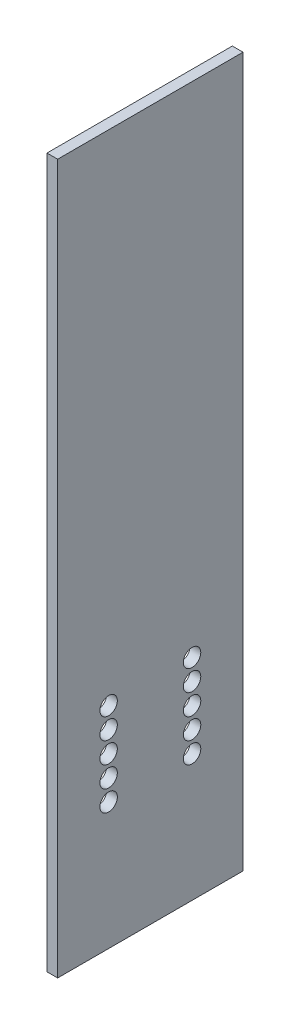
ISO-10303-21;
HEADER;
FILE_DESCRIPTION(('STEP AP214'),'2;1');
FILE_NAME('part.step','',(''),(''),'','','');
FILE_SCHEMA(('AUTOMOTIVE_DESIGN { 1 0 10303 214 1 1 1 1 }'));
ENDSEC;
DATA;
#1=APPLICATION_CONTEXT('core data for automotive mechanical design processes');
#2=APPLICATION_PROTOCOL_DEFINITION('international standard','automotive_design',2000,#1);
#3=PRODUCT_CONTEXT('',#1,'mechanical');
#4=PRODUCT('Part','Part','',(#3));
#5=PRODUCT_RELATED_PRODUCT_CATEGORY('part','',(#4));
#6=PRODUCT_DEFINITION_FORMATION('','',#4);
#7=PRODUCT_DEFINITION_CONTEXT('part definition',#1,'design');
#8=PRODUCT_DEFINITION('design','',#6,#7);
#9=PRODUCT_DEFINITION_SHAPE('','',#8);
#10=(LENGTH_UNIT() NAMED_UNIT(*) SI_UNIT(.MILLI.,.METRE.));
#11=(NAMED_UNIT(*) PLANE_ANGLE_UNIT() SI_UNIT($,.RADIAN.));
#12=(NAMED_UNIT(*) SI_UNIT($,.STERADIAN.) SOLID_ANGLE_UNIT());
#13=UNCERTAINTY_MEASURE_WITH_UNIT(LENGTH_MEASURE(1.E-05),#10,'distance_accuracy_value','');
#14=(GEOMETRIC_REPRESENTATION_CONTEXT(3) GLOBAL_UNCERTAINTY_ASSIGNED_CONTEXT((#13)) GLOBAL_UNIT_ASSIGNED_CONTEXT((#10,
#11,#12)) REPRESENTATION_CONTEXT('',''));
#15=CARTESIAN_POINT('',(0.,0.,0.));
#16=DIRECTION('',(0.,0.,1.));
#17=DIRECTION('',(1.,0.,0.));
#18=AXIS2_PLACEMENT_3D('',#15,#16,#17);
#19=CARTESIAN_POINT('',(0.,0.,0.));
#20=DIRECTION('',(1.,0.,0.));
#21=DIRECTION('',(0.,0.,-1.));
#22=AXIS2_PLACEMENT_3D('',#19,#20,#21);
#23=PLANE('',#22);
#24=CARTESIAN_POINT('',(0.,-79.4512,12.7));
#25=DIRECTION('',(-1.,0.,0.));
#26=DIRECTION('',(0.,0.,1.));
#27=AXIS2_PLACEMENT_3D('',#24,#25,#26);
#28=CIRCLE('',#27,2.65429999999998);
#29=CARTESIAN_POINT('',(0.,-79.4512,15.3543));
#30=VERTEX_POINT('',#29);
#31=EDGE_CURVE('E186',#30,#30,#28,.T.);
#32=ORIENTED_EDGE('',*,*,#31,.F.);
#33=EDGE_LOOP('',(#32));
#34=FACE_BOUND('',#33,.T.);
#35=CARTESIAN_POINT('',(0.,-85.8012,-12.7));
#36=DIRECTION('',(-1.,0.,0.));
#37=DIRECTION('',(0.,0.,1.));
#38=AXIS2_PLACEMENT_3D('',#35,#36,#37);
#39=CIRCLE('',#38,2.65429999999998);
#40=CARTESIAN_POINT('',(0.,-85.8012,-10.0457));
#41=VERTEX_POINT('',#40);
#42=EDGE_CURVE('E178',#41,#41,#39,.T.);
#43=ORIENTED_EDGE('',*,*,#42,.F.);
#44=EDGE_LOOP('',(#43));
#45=FACE_BOUND('',#44,.T.);
#46=CARTESIAN_POINT('',(0.,-85.8012,12.7));
#47=DIRECTION('',(-1.,0.,0.));
#48=DIRECTION('',(0.,0.,1.));
#49=AXIS2_PLACEMENT_3D('',#46,#47,#48);
#50=CIRCLE('',#49,2.65429999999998);
#51=CARTESIAN_POINT('',(0.,-85.8012,15.3543));
#52=VERTEX_POINT('',#51);
#53=EDGE_CURVE('E170',#52,#52,#50,.T.);
#54=ORIENTED_EDGE('',*,*,#53,.F.);
#55=EDGE_LOOP('',(#54));
#56=FACE_BOUND('',#55,.T.);
#57=CARTESIAN_POINT('',(0.,-92.1512,-12.7));
#58=DIRECTION('',(-1.,0.,0.));
#59=DIRECTION('',(0.,0.,1.));
#60=AXIS2_PLACEMENT_3D('',#57,#58,#59);
#61=CIRCLE('',#60,2.65429999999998);
#62=CARTESIAN_POINT('',(0.,-92.1512,-10.0457));
#63=VERTEX_POINT('',#62);
#64=EDGE_CURVE('E162',#63,#63,#61,.T.);
#65=ORIENTED_EDGE('',*,*,#64,.F.);
#66=EDGE_LOOP('',(#65));
#67=FACE_BOUND('',#66,.T.);
#68=CARTESIAN_POINT('',(0.,-104.8512,-12.7));
#69=DIRECTION('',(-1.,0.,0.));
#70=DIRECTION('',(0.,0.,1.));
#71=AXIS2_PLACEMENT_3D('',#68,#69,#70);
#72=CIRCLE('',#71,2.65429999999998);
#73=CARTESIAN_POINT('',(0.,-104.8512,-10.0457));
#74=VERTEX_POINT('',#73);
#75=EDGE_CURVE('E146',#74,#74,#72,.T.);
#76=ORIENTED_EDGE('',*,*,#75,.F.);
#77=EDGE_LOOP('',(#76));
#78=FACE_BOUND('',#77,.T.);
#79=CARTESIAN_POINT('',(0.,-98.5012,-12.7));
#80=DIRECTION('',(-1.,0.,0.));
#81=DIRECTION('',(0.,0.,1.));
#82=AXIS2_PLACEMENT_3D('',#79,#80,#81);
#83=CIRCLE('',#82,2.65429999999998);
#84=CARTESIAN_POINT('',(0.,-98.5012,-10.0457));
#85=VERTEX_POINT('',#84);
#86=EDGE_CURVE('E118',#85,#85,#83,.T.);
#87=ORIENTED_EDGE('',*,*,#86,.F.);
#88=EDGE_LOOP('',(#87));
#89=FACE_BOUND('',#88,.T.);
#90=CARTESIAN_POINT('',(0.,-98.5012,12.7));
#91=DIRECTION('',(-1.,0.,0.));
#92=DIRECTION('',(0.,0.,1.));
#93=AXIS2_PLACEMENT_3D('',#90,#91,#92);
#94=CIRCLE('',#93,2.65429999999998);
#95=CARTESIAN_POINT('',(0.,-98.5012,15.3543));
#96=VERTEX_POINT('',#95);
#97=EDGE_CURVE('E101',#96,#96,#94,.T.);
#98=ORIENTED_EDGE('',*,*,#97,.F.);
#99=EDGE_LOOP('',(#98));
#100=FACE_BOUND('',#99,.T.);
#101=DIRECTION('',(0.,-1.,0.));
#102=VECTOR('',#101,1.);
#103=CARTESIAN_POINT('',(0.,143.51,28.2194));
#104=LINE('',#103,#102);
#105=CARTESIAN_POINT('',(0.,72.39,28.2194));
#106=VERTEX_POINT('',#105);
#107=CARTESIAN_POINT('',(0.,-143.51,28.2194));
#108=VERTEX_POINT('',#107);
#109=EDGE_CURVE('E86',#106,#108,#104,.T.);
#110=ORIENTED_EDGE('',*,*,#109,.F.);
#111=DIRECTION('',(0.,0.,1.));
#112=VECTOR('',#111,1.);
#113=CARTESIAN_POINT('',(0.,72.39,-28.2194));
#114=LINE('',#113,#112);
#115=CARTESIAN_POINT('',(0.,72.39,-28.2194));
#116=VERTEX_POINT('',#115);
#117=EDGE_CURVE('E93',#116,#106,#114,.T.);
#118=ORIENTED_EDGE('',*,*,#117,.F.);
#119=DIRECTION('',(0.,1.,0.));
#120=VECTOR('',#119,1.);
#121=CARTESIAN_POINT('',(0.,143.51,-28.2194));
#122=LINE('',#121,#120);
#123=CARTESIAN_POINT('',(0.,-143.51,-28.2194));
#124=VERTEX_POINT('',#123);
#125=EDGE_CURVE('E90',#124,#116,#122,.T.);
#126=ORIENTED_EDGE('',*,*,#125,.F.);
#127=DIRECTION('',(0.,0.,-1.));
#128=VECTOR('',#127,1.);
#129=CARTESIAN_POINT('',(0.,-143.51,28.2194));
#130=LINE('',#129,#128);
#131=EDGE_CURVE('E76',#108,#124,#130,.T.);
#132=ORIENTED_EDGE('',*,*,#131,.F.);
#133=EDGE_LOOP('',(#110,#118,#126,#132));
#134=FACE_BOUND('',#133,.T.);
#135=CARTESIAN_POINT('',(0.,-104.8512,12.7));
#136=DIRECTION('',(-1.,0.,0.));
#137=DIRECTION('',(0.,0.,1.));
#138=AXIS2_PLACEMENT_3D('',#135,#136,#137);
#139=CIRCLE('',#138,2.65429999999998);
#140=CARTESIAN_POINT('',(0.,-104.8512,15.3543));
#141=VERTEX_POINT('',#140);
#142=EDGE_CURVE('E138',#141,#141,#139,.T.);
#143=ORIENTED_EDGE('',*,*,#142,.F.);
#144=EDGE_LOOP('',(#143));
#145=FACE_BOUND('',#144,.T.);
#146=CARTESIAN_POINT('',(0.,-92.1512,12.7));
#147=DIRECTION('',(-1.,0.,0.));
#148=DIRECTION('',(0.,0.,1.));
#149=AXIS2_PLACEMENT_3D('',#146,#147,#148);
#150=CIRCLE('',#149,2.65429999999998);
#151=CARTESIAN_POINT('',(0.,-92.1512,15.3543));
#152=VERTEX_POINT('',#151);
#153=EDGE_CURVE('E154',#152,#152,#150,.T.);
#154=ORIENTED_EDGE('',*,*,#153,.F.);
#155=EDGE_LOOP('',(#154));
#156=FACE_BOUND('',#155,.T.);
#157=CARTESIAN_POINT('',(0.,-79.4512,-12.7));
#158=DIRECTION('',(-1.,0.,0.));
#159=DIRECTION('',(0.,0.,1.));
#160=AXIS2_PLACEMENT_3D('',#157,#158,#159);
#161=CIRCLE('',#160,2.65429999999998);
#162=CARTESIAN_POINT('',(0.,-79.4512,-10.0457));
#163=VERTEX_POINT('',#162);
#164=EDGE_CURVE('E194',#163,#163,#161,.T.);
#165=ORIENTED_EDGE('',*,*,#164,.F.);
#166=EDGE_LOOP('',(#165));
#167=FACE_BOUND('',#166,.T.);
#168=ADVANCED_FACE('F39',(#34,#45,#56,#67,#78,#89,#100,#134,#145,#156,#167),#23,.F.);
#169=CARTESIAN_POINT('',(3.2512,0.,0.));
#170=DIRECTION('',(1.,0.,0.));
#171=DIRECTION('',(0.,0.,-1.));
#172=AXIS2_PLACEMENT_3D('',#169,#170,#171);
#173=PLANE('',#172);
#174=CARTESIAN_POINT('',(3.2512,-79.4512,-12.7));
#175=DIRECTION('',(-1.,0.,0.));
#176=DIRECTION('',(0.,0.,1.));
#177=AXIS2_PLACEMENT_3D('',#174,#175,#176);
#178=CIRCLE('',#177,2.6543);
#179=CARTESIAN_POINT('',(3.2512,-79.4512,-10.0457));
#180=VERTEX_POINT('',#179);
#181=EDGE_CURVE('E190',#180,#180,#178,.T.);
#182=ORIENTED_EDGE('',*,*,#181,.T.);
#183=EDGE_LOOP('',(#182));
#184=FACE_BOUND('',#183,.T.);
#185=CARTESIAN_POINT('',(3.2512,-79.4512,12.7));
#186=DIRECTION('',(-1.,0.,0.));
#187=DIRECTION('',(0.,0.,1.));
#188=AXIS2_PLACEMENT_3D('',#185,#186,#187);
#189=CIRCLE('',#188,2.6543);
#190=CARTESIAN_POINT('',(3.2512,-79.4512,15.3543));
#191=VERTEX_POINT('',#190);
#192=EDGE_CURVE('E182',#191,#191,#189,.T.);
#193=ORIENTED_EDGE('',*,*,#192,.T.);
#194=EDGE_LOOP('',(#193));
#195=FACE_BOUND('',#194,.T.);
#196=CARTESIAN_POINT('',(3.2512,-85.8012,-12.7));
#197=DIRECTION('',(-1.,0.,0.));
#198=DIRECTION('',(0.,0.,1.));
#199=AXIS2_PLACEMENT_3D('',#196,#197,#198);
#200=CIRCLE('',#199,2.6543);
#201=CARTESIAN_POINT('',(3.2512,-85.8012,-10.0457));
#202=VERTEX_POINT('',#201);
#203=EDGE_CURVE('E174',#202,#202,#200,.T.);
#204=ORIENTED_EDGE('',*,*,#203,.T.);
#205=EDGE_LOOP('',(#204));
#206=FACE_BOUND('',#205,.T.);
#207=CARTESIAN_POINT('',(3.2512,-85.8012,12.7));
#208=DIRECTION('',(-1.,0.,0.));
#209=DIRECTION('',(0.,0.,1.));
#210=AXIS2_PLACEMENT_3D('',#207,#208,#209);
#211=CIRCLE('',#210,2.6543);
#212=CARTESIAN_POINT('',(3.2512,-85.8012,15.3543));
#213=VERTEX_POINT('',#212);
#214=EDGE_CURVE('E166',#213,#213,#211,.T.);
#215=ORIENTED_EDGE('',*,*,#214,.T.);
#216=EDGE_LOOP('',(#215));
#217=FACE_BOUND('',#216,.T.);
#218=CARTESIAN_POINT('',(3.2512,-98.5012,12.7));
#219=DIRECTION('',(-1.,0.,0.));
#220=DIRECTION('',(0.,0.,1.));
#221=AXIS2_PLACEMENT_3D('',#218,#219,#220);
#222=CIRCLE('',#221,2.6543);
#223=CARTESIAN_POINT('',(3.2512,-98.5012,15.3543));
#224=VERTEX_POINT('',#223);
#225=EDGE_CURVE('E95',#224,#224,#222,.T.);
#226=ORIENTED_EDGE('',*,*,#225,.T.);
#227=EDGE_LOOP('',(#226));
#228=FACE_BOUND('',#227,.T.);
#229=CARTESIAN_POINT('',(3.2512,-98.5012,-12.7));
#230=DIRECTION('',(-1.,0.,0.));
#231=DIRECTION('',(0.,0.,1.));
#232=AXIS2_PLACEMENT_3D('',#229,#230,#231);
#233=CIRCLE('',#232,2.6543);
#234=CARTESIAN_POINT('',(3.2512,-98.5012,-10.0457));
#235=VERTEX_POINT('',#234);
#236=EDGE_CURVE('E114',#235,#235,#233,.T.);
#237=ORIENTED_EDGE('',*,*,#236,.T.);
#238=EDGE_LOOP('',(#237));
#239=FACE_BOUND('',#238,.T.);
#240=DIRECTION('',(0.,0.,1.));
#241=VECTOR('',#240,1.);
#242=CARTESIAN_POINT('',(3.2512,72.39,-28.2194));
#243=LINE('',#242,#241);
#244=CARTESIAN_POINT('',(3.2512,72.39,-28.2194));
#245=VERTEX_POINT('',#244);
#246=CARTESIAN_POINT('',(3.2512,72.39,28.2194));
#247=VERTEX_POINT('',#246);
#248=EDGE_CURVE('E122',#245,#247,#243,.T.);
#249=ORIENTED_EDGE('',*,*,#248,.T.);
#250=DIRECTION('',(0.,-1.,0.));
#251=VECTOR('',#250,1.);
#252=CARTESIAN_POINT('',(3.2512,143.51,28.2194));
#253=LINE('',#252,#251);
#254=CARTESIAN_POINT('',(3.2512,-143.51,28.2194));
#255=VERTEX_POINT('',#254);
#256=EDGE_CURVE('E106',#247,#255,#253,.T.);
#257=ORIENTED_EDGE('',*,*,#256,.T.);
#258=DIRECTION('',(0.,0.,-1.));
#259=VECTOR('',#258,1.);
#260=CARTESIAN_POINT('',(3.2512,-143.51,28.2194));
#261=LINE('',#260,#259);
#262=CARTESIAN_POINT('',(3.2512,-143.51,-28.2194));
#263=VERTEX_POINT('',#262);
#264=EDGE_CURVE('E64',#255,#263,#261,.T.);
#265=ORIENTED_EDGE('',*,*,#264,.T.);
#266=DIRECTION('',(0.,1.,0.));
#267=VECTOR('',#266,1.);
#268=CARTESIAN_POINT('',(3.2512,143.51,-28.2194));
#269=LINE('',#268,#267);
#270=EDGE_CURVE('E85',#263,#245,#269,.T.);
#271=ORIENTED_EDGE('',*,*,#270,.T.);
#272=EDGE_LOOP('',(#249,#257,#265,#271));
#273=FACE_BOUND('',#272,.T.);
#274=CARTESIAN_POINT('',(3.2512,-104.8512,12.7));
#275=DIRECTION('',(-1.,0.,0.));
#276=DIRECTION('',(0.,0.,1.));
#277=AXIS2_PLACEMENT_3D('',#274,#275,#276);
#278=CIRCLE('',#277,2.6543);
#279=CARTESIAN_POINT('',(3.2512,-104.8512,15.3543));
#280=VERTEX_POINT('',#279);
#281=EDGE_CURVE('E134',#280,#280,#278,.T.);
#282=ORIENTED_EDGE('',*,*,#281,.T.);
#283=EDGE_LOOP('',(#282));
#284=FACE_BOUND('',#283,.T.);
#285=CARTESIAN_POINT('',(3.2512,-104.8512,-12.7));
#286=DIRECTION('',(-1.,0.,0.));
#287=DIRECTION('',(0.,0.,1.));
#288=AXIS2_PLACEMENT_3D('',#285,#286,#287);
#289=CIRCLE('',#288,2.6543);
#290=CARTESIAN_POINT('',(3.2512,-104.8512,-10.0457));
#291=VERTEX_POINT('',#290);
#292=EDGE_CURVE('E142',#291,#291,#289,.T.);
#293=ORIENTED_EDGE('',*,*,#292,.T.);
#294=EDGE_LOOP('',(#293));
#295=FACE_BOUND('',#294,.T.);
#296=CARTESIAN_POINT('',(3.2512,-92.1512,12.7));
#297=DIRECTION('',(-1.,0.,0.));
#298=DIRECTION('',(0.,0.,1.));
#299=AXIS2_PLACEMENT_3D('',#296,#297,#298);
#300=CIRCLE('',#299,2.6543);
#301=CARTESIAN_POINT('',(3.2512,-92.1512,15.3543));
#302=VERTEX_POINT('',#301);
#303=EDGE_CURVE('E150',#302,#302,#300,.T.);
#304=ORIENTED_EDGE('',*,*,#303,.T.);
#305=EDGE_LOOP('',(#304));
#306=FACE_BOUND('',#305,.T.);
#307=CARTESIAN_POINT('',(3.2512,-92.1512,-12.7));
#308=DIRECTION('',(-1.,0.,0.));
#309=DIRECTION('',(0.,0.,1.));
#310=AXIS2_PLACEMENT_3D('',#307,#308,#309);
#311=CIRCLE('',#310,2.6543);
#312=CARTESIAN_POINT('',(3.2512,-92.1512,-10.0457));
#313=VERTEX_POINT('',#312);
#314=EDGE_CURVE('E158',#313,#313,#311,.T.);
#315=ORIENTED_EDGE('',*,*,#314,.T.);
#316=EDGE_LOOP('',(#315));
#317=FACE_BOUND('',#316,.T.);
#318=ADVANCED_FACE('F202',(#184,#195,#206,#217,#228,#239,#273,#284,#295,#306,#317),#173,.T.);
#319=CARTESIAN_POINT('',(3.2512,143.51,-28.2194));
#320=DIRECTION('',(0.,0.,1.));
#321=DIRECTION('',(0.,-1.,0.));
#322=AXIS2_PLACEMENT_3D('',#319,#320,#321);
#323=PLANE('',#322);
#324=ORIENTED_EDGE('',*,*,#125,.T.);
#325=DIRECTION('',(-1.,0.,0.));
#326=VECTOR('',#325,1.);
#327=CARTESIAN_POINT('',(3.2522,72.39,-28.2194));
#328=LINE('',#327,#326);
#329=EDGE_CURVE('E55',#245,#116,#328,.T.);
#330=ORIENTED_EDGE('',*,*,#329,.F.);
#331=ORIENTED_EDGE('',*,*,#270,.F.);
#332=DIRECTION('',(-1.,0.,0.));
#333=VECTOR('',#332,1.);
#334=CARTESIAN_POINT('',(3.2512,-143.51,-28.2194));
#335=LINE('',#334,#333);
#336=EDGE_CURVE('E48',#263,#124,#335,.T.);
#337=ORIENTED_EDGE('',*,*,#336,.T.);
#338=EDGE_LOOP('',(#324,#330,#331,#337));
#339=FACE_BOUND('',#338,.T.);
#340=ADVANCED_FACE('F41',(#339),#323,.F.);
#341=CARTESIAN_POINT('',(3.2512,143.51,28.2194));
#342=DIRECTION('',(0.,0.,-1.));
#343=DIRECTION('',(0.,1.,0.));
#344=AXIS2_PLACEMENT_3D('',#341,#342,#343);
#345=PLANE('',#344);
#346=ORIENTED_EDGE('',*,*,#256,.F.);
#347=DIRECTION('',(-1.,0.,0.));
#348=VECTOR('',#347,1.);
#349=CARTESIAN_POINT('',(3.2522,72.39,28.2194));
#350=LINE('',#349,#348);
#351=EDGE_CURVE('E126',#247,#106,#350,.T.);
#352=ORIENTED_EDGE('',*,*,#351,.T.);
#353=ORIENTED_EDGE('',*,*,#109,.T.);
#354=DIRECTION('',(-1.,0.,0.));
#355=VECTOR('',#354,1.);
#356=CARTESIAN_POINT('',(3.2512,-143.51,28.2194));
#357=LINE('',#356,#355);
#358=EDGE_CURVE('E11',#255,#108,#357,.T.);
#359=ORIENTED_EDGE('',*,*,#358,.F.);
#360=EDGE_LOOP('',(#346,#352,#353,#359));
#361=FACE_BOUND('',#360,.T.);
#362=ADVANCED_FACE('F217',(#361),#345,.F.);
#363=CARTESIAN_POINT('',(3.2512,-143.51,28.2194));
#364=DIRECTION('',(0.,1.,0.));
#365=DIRECTION('',(0.,0.,1.));
#366=AXIS2_PLACEMENT_3D('',#363,#364,#365);
#367=PLANE('',#366);
#368=ORIENTED_EDGE('',*,*,#131,.T.);
#369=ORIENTED_EDGE('',*,*,#336,.F.);
#370=ORIENTED_EDGE('',*,*,#264,.F.);
#371=ORIENTED_EDGE('',*,*,#358,.T.);
#372=EDGE_LOOP('',(#368,#369,#370,#371));
#373=FACE_BOUND('',#372,.T.);
#374=ADVANCED_FACE('F78',(#373),#367,.F.);
#375=CARTESIAN_POINT('',(0.,-98.5012,12.7));
#376=DIRECTION('',(-1.,0.,0.));
#377=DIRECTION('',(0.,0.,1.));
#378=AXIS2_PLACEMENT_3D('',#375,#376,#377);
#379=CYLINDRICAL_SURFACE('',#378,2.65429999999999);
#380=ORIENTED_EDGE('',*,*,#225,.F.);
#381=EDGE_LOOP('',(#380));
#382=FACE_BOUND('',#381,.T.);
#383=ORIENTED_EDGE('',*,*,#97,.T.);
#384=EDGE_LOOP('',(#383));
#385=FACE_BOUND('',#384,.T.);
#386=ADVANCED_FACE('F216',(#382,#385),#379,.F.);
#387=CARTESIAN_POINT('',(0.,-98.5012,-12.7));
#388=DIRECTION('',(-1.,0.,0.));
#389=DIRECTION('',(0.,0.,1.));
#390=AXIS2_PLACEMENT_3D('',#387,#388,#389);
#391=CYLINDRICAL_SURFACE('',#390,2.65429999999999);
#392=ORIENTED_EDGE('',*,*,#236,.F.);
#393=EDGE_LOOP('',(#392));
#394=FACE_BOUND('',#393,.T.);
#395=ORIENTED_EDGE('',*,*,#86,.T.);
#396=EDGE_LOOP('',(#395));
#397=FACE_BOUND('',#396,.T.);
#398=ADVANCED_FACE('F233',(#394,#397),#391,.F.);
#399=CARTESIAN_POINT('',(3.2522,72.39,-28.2194));
#400=DIRECTION('',(0.,-1.,0.));
#401=DIRECTION('',(0.,0.,-1.));
#402=AXIS2_PLACEMENT_3D('',#399,#400,#401);
#403=PLANE('',#402);
#404=ORIENTED_EDGE('',*,*,#329,.T.);
#405=ORIENTED_EDGE('',*,*,#117,.T.);
#406=ORIENTED_EDGE('',*,*,#351,.F.);
#407=ORIENTED_EDGE('',*,*,#248,.F.);
#408=EDGE_LOOP('',(#404,#405,#406,#407));
#409=FACE_BOUND('',#408,.T.);
#410=ADVANCED_FACE('F228',(#409),#403,.F.);
#411=CARTESIAN_POINT('',(0.,-104.8512,12.7));
#412=DIRECTION('',(-1.,0.,0.));
#413=DIRECTION('',(0.,0.,1.));
#414=AXIS2_PLACEMENT_3D('',#411,#412,#413);
#415=CYLINDRICAL_SURFACE('',#414,2.65429999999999);
#416=ORIENTED_EDGE('',*,*,#281,.F.);
#417=EDGE_LOOP('',(#416));
#418=FACE_BOUND('',#417,.T.);
#419=ORIENTED_EDGE('',*,*,#142,.T.);
#420=EDGE_LOOP('',(#419));
#421=FACE_BOUND('',#420,.T.);
#422=ADVANCED_FACE('F232',(#418,#421),#415,.F.);
#423=CARTESIAN_POINT('',(0.,-104.8512,-12.7));
#424=DIRECTION('',(-1.,0.,0.));
#425=DIRECTION('',(0.,0.,1.));
#426=AXIS2_PLACEMENT_3D('',#423,#424,#425);
#427=CYLINDRICAL_SURFACE('',#426,2.65429999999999);
#428=ORIENTED_EDGE('',*,*,#292,.F.);
#429=EDGE_LOOP('',(#428));
#430=FACE_BOUND('',#429,.T.);
#431=ORIENTED_EDGE('',*,*,#75,.T.);
#432=EDGE_LOOP('',(#431));
#433=FACE_BOUND('',#432,.T.);
#434=ADVANCED_FACE('F238',(#430,#433),#427,.F.);
#435=CARTESIAN_POINT('',(0.,-92.1512,12.7));
#436=DIRECTION('',(-1.,0.,0.));
#437=DIRECTION('',(0.,0.,1.));
#438=AXIS2_PLACEMENT_3D('',#435,#436,#437);
#439=CYLINDRICAL_SURFACE('',#438,2.65429999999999);
#440=ORIENTED_EDGE('',*,*,#303,.F.);
#441=EDGE_LOOP('',(#440));
#442=FACE_BOUND('',#441,.T.);
#443=ORIENTED_EDGE('',*,*,#153,.T.);
#444=EDGE_LOOP('',(#443));
#445=FACE_BOUND('',#444,.T.);
#446=ADVANCED_FACE('F304',(#442,#445),#439,.F.);
#447=CARTESIAN_POINT('',(0.,-92.1512,-12.7));
#448=DIRECTION('',(-1.,0.,0.));
#449=DIRECTION('',(0.,0.,1.));
#450=AXIS2_PLACEMENT_3D('',#447,#448,#449);
#451=CYLINDRICAL_SURFACE('',#450,2.65429999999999);
#452=ORIENTED_EDGE('',*,*,#314,.F.);
#453=EDGE_LOOP('',(#452));
#454=FACE_BOUND('',#453,.T.);
#455=ORIENTED_EDGE('',*,*,#64,.T.);
#456=EDGE_LOOP('',(#455));
#457=FACE_BOUND('',#456,.T.);
#458=ADVANCED_FACE('F312',(#454,#457),#451,.F.);
#459=CARTESIAN_POINT('',(0.,-85.8012,12.7));
#460=DIRECTION('',(-1.,0.,0.));
#461=DIRECTION('',(0.,0.,1.));
#462=AXIS2_PLACEMENT_3D('',#459,#460,#461);
#463=CYLINDRICAL_SURFACE('',#462,2.65429999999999);
#464=ORIENTED_EDGE('',*,*,#214,.F.);
#465=EDGE_LOOP('',(#464));
#466=FACE_BOUND('',#465,.T.);
#467=ORIENTED_EDGE('',*,*,#53,.T.);
#468=EDGE_LOOP('',(#467));
#469=FACE_BOUND('',#468,.T.);
#470=ADVANCED_FACE('F321',(#466,#469),#463,.F.);
#471=CARTESIAN_POINT('',(0.,-85.8012,-12.7));
#472=DIRECTION('',(-1.,0.,0.));
#473=DIRECTION('',(0.,0.,1.));
#474=AXIS2_PLACEMENT_3D('',#471,#472,#473);
#475=CYLINDRICAL_SURFACE('',#474,2.65429999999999);
#476=ORIENTED_EDGE('',*,*,#203,.F.);
#477=EDGE_LOOP('',(#476));
#478=FACE_BOUND('',#477,.T.);
#479=ORIENTED_EDGE('',*,*,#42,.T.);
#480=EDGE_LOOP('',(#479));
#481=FACE_BOUND('',#480,.T.);
#482=ADVANCED_FACE('F330',(#478,#481),#475,.F.);
#483=CARTESIAN_POINT('',(0.,-79.4512,12.7));
#484=DIRECTION('',(-1.,0.,0.));
#485=DIRECTION('',(0.,0.,1.));
#486=AXIS2_PLACEMENT_3D('',#483,#484,#485);
#487=CYLINDRICAL_SURFACE('',#486,2.65429999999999);
#488=ORIENTED_EDGE('',*,*,#192,.F.);
#489=EDGE_LOOP('',(#488));
#490=FACE_BOUND('',#489,.T.);
#491=ORIENTED_EDGE('',*,*,#31,.T.);
#492=EDGE_LOOP('',(#491));
#493=FACE_BOUND('',#492,.T.);
#494=ADVANCED_FACE('F339',(#490,#493),#487,.F.);
#495=CARTESIAN_POINT('',(0.,-79.4512,-12.7));
#496=DIRECTION('',(-1.,0.,0.));
#497=DIRECTION('',(0.,0.,1.));
#498=AXIS2_PLACEMENT_3D('',#495,#496,#497);
#499=CYLINDRICAL_SURFACE('',#498,2.65429999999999);
#500=ORIENTED_EDGE('',*,*,#181,.F.);
#501=EDGE_LOOP('',(#500));
#502=FACE_BOUND('',#501,.T.);
#503=ORIENTED_EDGE('',*,*,#164,.T.);
#504=EDGE_LOOP('',(#503));
#505=FACE_BOUND('',#504,.T.);
#506=ADVANCED_FACE('F199',(#502,#505),#499,.F.);
#507=CLOSED_SHELL('',(#168,#318,#340,#362,#374,#386,#398,#410,#422,#434,#446,#458,#470,#482,
#494,#506));
#508=MANIFOLD_SOLID_BREP('B2',#507);
#509=ADVANCED_BREP_SHAPE_REPRESENTATION('',(#18,#508),#14);
#510=SHAPE_DEFINITION_REPRESENTATION(#9,#509);
ENDSEC;
END-ISO-10303-21;
